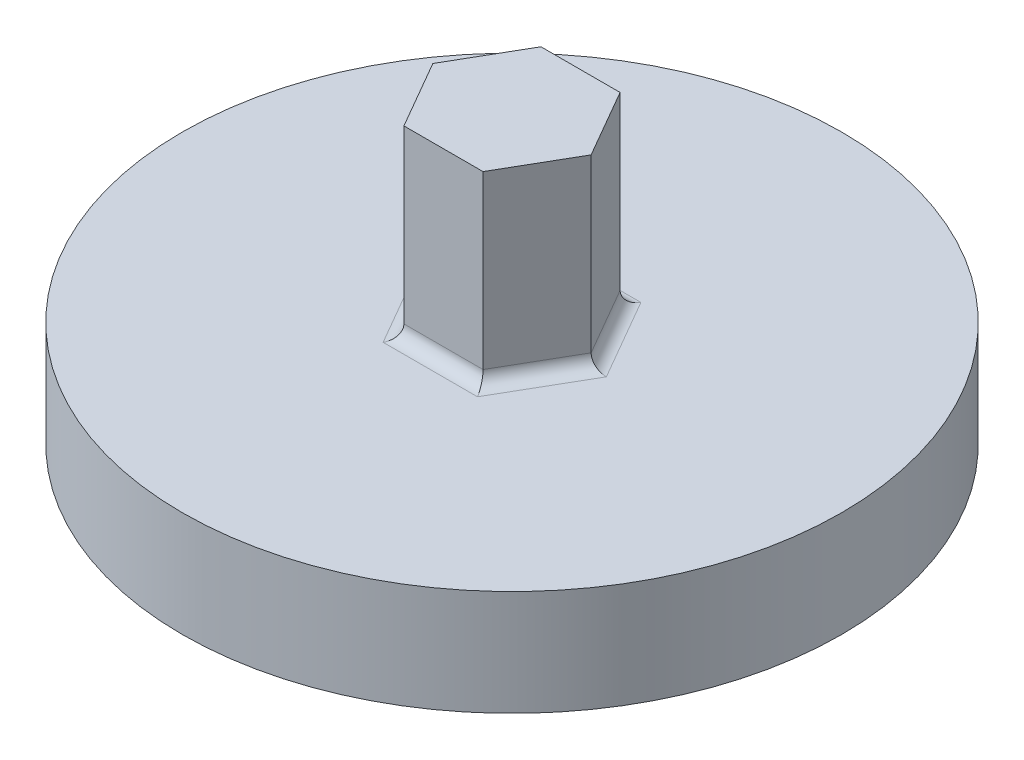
from build123d import *

# Parameters (mm, degrees)
CROQUIS1_R              = 12.5
SALIENTE_EXTRUIR1_DEPTH = 4
SALIENTE_EXTRUIR2_DEPTH = 7
REDONDEO1_R             = 0.5


with BuildPart() as part:
    # Croquis1 → Saliente-Extruir1 (new body)
    with BuildSketch(Plane(origin=(0, 0, 0), x_dir=(1, 0, 0), z_dir=(0, 1, 0))):
        with Locations(Location((0, 0, 0), (0, 0, 270))):
            Circle(CROQUIS1_R)
    extrude(amount=SALIENTE_EXTRUIR1_DEPTH)

    # Croquis2 → Saliente-Extruir2 (add)
    with BuildSketch(Plane(origin=(0, 4, 0), x_dir=(1, 0, 0), z_dir=(0, 1, 0))):
        Polygon((3, 0), (1.5, 2.598076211), (-1.5, 2.598076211), (-3, 0), (-1.5, -2.598076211), (1.5, -2.598076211), align=None)
    extrude(amount=SALIENTE_EXTRUIR2_DEPTH)

    # Redondeo1
    redondeo1_edges = [part.edges().sort_by_distance(p)[0] for p in [
        (0, 4, 2.598076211),
        (2.25, 4, 1.299038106),
        (2.25, 4, -1.299038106),
        (0, 4, -2.598076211),
        (-2.25, 4, -1.299038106),
        (-2.25, 4, 1.299038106),
    ]]
    fillet(redondeo1_edges, radius=REDONDEO1_R)


solid = part.part
